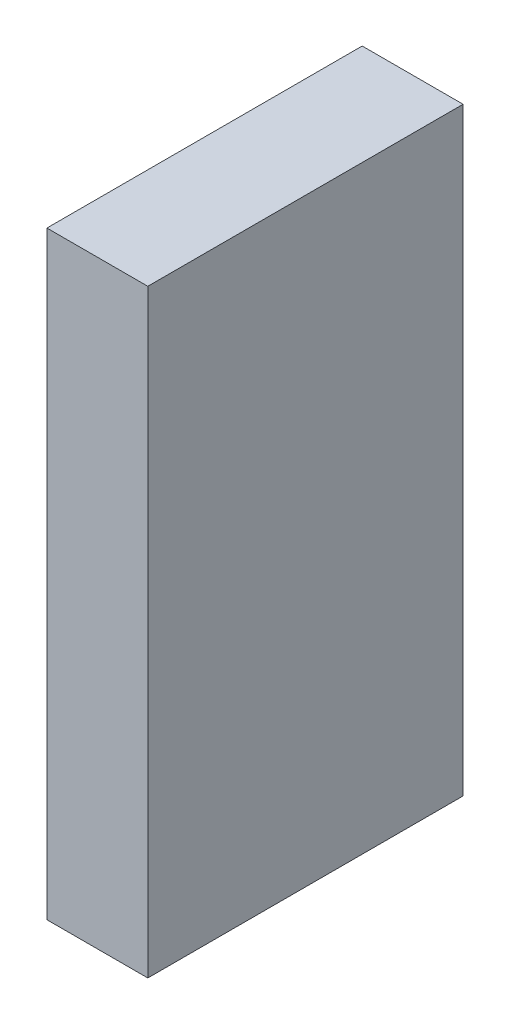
ISO-10303-21;
HEADER;
FILE_DESCRIPTION(('STEP AP214'),'2;1');
FILE_NAME('part.step','',(''),(''),'','','');
FILE_SCHEMA(('AUTOMOTIVE_DESIGN { 1 0 10303 214 1 1 1 1 }'));
ENDSEC;
DATA;
#1=APPLICATION_CONTEXT('core data for automotive mechanical design processes');
#2=APPLICATION_PROTOCOL_DEFINITION('international standard','automotive_design',2000,#1);
#3=PRODUCT_CONTEXT('',#1,'mechanical');
#4=PRODUCT('Part','Part','',(#3));
#5=PRODUCT_RELATED_PRODUCT_CATEGORY('part','',(#4));
#6=PRODUCT_DEFINITION_FORMATION('','',#4);
#7=PRODUCT_DEFINITION_CONTEXT('part definition',#1,'design');
#8=PRODUCT_DEFINITION('design','',#6,#7);
#9=PRODUCT_DEFINITION_SHAPE('','',#8);
#10=(LENGTH_UNIT() NAMED_UNIT(*) SI_UNIT(.MILLI.,.METRE.));
#11=(NAMED_UNIT(*) PLANE_ANGLE_UNIT() SI_UNIT($,.RADIAN.));
#12=(NAMED_UNIT(*) SI_UNIT($,.STERADIAN.) SOLID_ANGLE_UNIT());
#13=UNCERTAINTY_MEASURE_WITH_UNIT(LENGTH_MEASURE(1.E-05),#10,'distance_accuracy_value','');
#14=(GEOMETRIC_REPRESENTATION_CONTEXT(3) GLOBAL_UNCERTAINTY_ASSIGNED_CONTEXT((#13)) GLOBAL_UNIT_ASSIGNED_CONTEXT((#10,
#11,#12)) REPRESENTATION_CONTEXT('',''));
#15=CARTESIAN_POINT('',(0.,0.,0.));
#16=DIRECTION('',(0.,0.,1.));
#17=DIRECTION('',(1.,0.,0.));
#18=AXIS2_PLACEMENT_3D('',#15,#16,#17);
#19=CARTESIAN_POINT('',(0.,0.,25.));
#20=DIRECTION('',(1.,0.,0.));
#21=DIRECTION('',(0.,1.,0.));
#22=AXIS2_PLACEMENT_3D('',#19,#20,#21);
#23=PLANE('',#22);
#24=DIRECTION('',(0.,-1.,0.));
#25=VECTOR('',#24,1.);
#26=CARTESIAN_POINT('',(0.,0.,0.));
#27=LINE('',#26,#25);
#28=CARTESIAN_POINT('',(0.,47.5,0.));
#29=VERTEX_POINT('',#28);
#30=CARTESIAN_POINT('',(0.,0.,0.));
#31=VERTEX_POINT('',#30);
#32=EDGE_CURVE('E93',#29,#31,#27,.T.);
#33=ORIENTED_EDGE('',*,*,#32,.T.);
#34=DIRECTION('',(0.,0.,-1.));
#35=VECTOR('',#34,1.);
#36=CARTESIAN_POINT('',(0.,0.,25.));
#37=LINE('',#36,#35);
#38=CARTESIAN_POINT('',(0.,0.,25.));
#39=VERTEX_POINT('',#38);
#40=EDGE_CURVE('E11',#39,#31,#37,.T.);
#41=ORIENTED_EDGE('',*,*,#40,.F.);
#42=DIRECTION('',(0.,-1.,0.));
#43=VECTOR('',#42,1.);
#44=CARTESIAN_POINT('',(0.,0.,25.));
#45=LINE('',#44,#43);
#46=CARTESIAN_POINT('',(0.,47.5,25.));
#47=VERTEX_POINT('',#46);
#48=EDGE_CURVE('E81',#47,#39,#45,.T.);
#49=ORIENTED_EDGE('',*,*,#48,.F.);
#50=DIRECTION('',(0.,0.,-1.));
#51=VECTOR('',#50,1.);
#52=CARTESIAN_POINT('',(0.,47.5,25.));
#53=LINE('',#52,#51);
#54=EDGE_CURVE('E89',#47,#29,#53,.T.);
#55=ORIENTED_EDGE('',*,*,#54,.T.);
#56=EDGE_LOOP('',(#33,#41,#49,#55));
#57=FACE_BOUND('',#56,.T.);
#58=ADVANCED_FACE('F30',(#57),#23,.F.);
#59=CARTESIAN_POINT('',(0.,0.,25.));
#60=DIRECTION('',(0.,1.,0.));
#61=DIRECTION('',(0.,0.,1.));
#62=AXIS2_PLACEMENT_3D('',#59,#60,#61);
#63=PLANE('',#62);
#64=DIRECTION('',(1.,0.,0.));
#65=VECTOR('',#64,1.);
#66=CARTESIAN_POINT('',(0.,0.,0.));
#67=LINE('',#66,#65);
#68=CARTESIAN_POINT('',(8.,0.,0.));
#69=VERTEX_POINT('',#68);
#70=EDGE_CURVE('E85',#31,#69,#67,.T.);
#71=ORIENTED_EDGE('',*,*,#70,.T.);
#72=DIRECTION('',(0.,0.,-1.));
#73=VECTOR('',#72,1.);
#74=CARTESIAN_POINT('',(8.,0.,25.));
#75=LINE('',#74,#73);
#76=CARTESIAN_POINT('',(8.,0.,25.));
#77=VERTEX_POINT('',#76);
#78=EDGE_CURVE('E38',#77,#69,#75,.T.);
#79=ORIENTED_EDGE('',*,*,#78,.F.);
#80=DIRECTION('',(1.,0.,0.));
#81=VECTOR('',#80,1.);
#82=CARTESIAN_POINT('',(0.,0.,25.));
#83=LINE('',#82,#81);
#84=EDGE_CURVE('E76',#39,#77,#83,.T.);
#85=ORIENTED_EDGE('',*,*,#84,.F.);
#86=ORIENTED_EDGE('',*,*,#40,.T.);
#87=EDGE_LOOP('',(#71,#79,#85,#86));
#88=FACE_BOUND('',#87,.T.);
#89=ADVANCED_FACE('F84',(#88),#63,.F.);
#90=CARTESIAN_POINT('',(8.,0.,25.));
#91=DIRECTION('',(-1.,0.,0.));
#92=DIRECTION('',(0.,-1.,0.));
#93=AXIS2_PLACEMENT_3D('',#90,#91,#92);
#94=PLANE('',#93);
#95=DIRECTION('',(0.,1.,0.));
#96=VECTOR('',#95,1.);
#97=CARTESIAN_POINT('',(8.,0.,0.));
#98=LINE('',#97,#96);
#99=CARTESIAN_POINT('',(7.99999999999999,47.5,0.));
#100=VERTEX_POINT('',#99);
#101=EDGE_CURVE('E63',#69,#100,#98,.T.);
#102=ORIENTED_EDGE('',*,*,#101,.T.);
#103=DIRECTION('',(0.,0.,-1.));
#104=VECTOR('',#103,1.);
#105=CARTESIAN_POINT('',(7.99999999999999,47.5,25.));
#106=LINE('',#105,#104);
#107=CARTESIAN_POINT('',(7.99999999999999,47.5,25.));
#108=VERTEX_POINT('',#107);
#109=EDGE_CURVE('E86',#108,#100,#106,.T.);
#110=ORIENTED_EDGE('',*,*,#109,.F.);
#111=DIRECTION('',(0.,1.,0.));
#112=VECTOR('',#111,1.);
#113=CARTESIAN_POINT('',(8.,0.,25.));
#114=LINE('',#113,#112);
#115=EDGE_CURVE('E79',#77,#108,#114,.T.);
#116=ORIENTED_EDGE('',*,*,#115,.F.);
#117=ORIENTED_EDGE('',*,*,#78,.T.);
#118=EDGE_LOOP('',(#102,#110,#116,#117));
#119=FACE_BOUND('',#118,.T.);
#120=ADVANCED_FACE('F87',(#119),#94,.F.);
#121=CARTESIAN_POINT('',(0.,47.5,25.));
#122=DIRECTION('',(0.,-1.,0.));
#123=DIRECTION('',(0.,0.,-1.));
#124=AXIS2_PLACEMENT_3D('',#121,#122,#123);
#125=PLANE('',#124);
#126=DIRECTION('',(-1.,0.,0.));
#127=VECTOR('',#126,1.);
#128=CARTESIAN_POINT('',(0.,47.5,0.));
#129=LINE('',#128,#127);
#130=EDGE_CURVE('E69',#100,#29,#129,.T.);
#131=ORIENTED_EDGE('',*,*,#130,.T.);
#132=ORIENTED_EDGE('',*,*,#54,.F.);
#133=DIRECTION('',(-1.,0.,0.));
#134=VECTOR('',#133,1.);
#135=CARTESIAN_POINT('',(0.,47.5,25.));
#136=LINE('',#135,#134);
#137=EDGE_CURVE('E46',#108,#47,#136,.T.);
#138=ORIENTED_EDGE('',*,*,#137,.F.);
#139=ORIENTED_EDGE('',*,*,#109,.T.);
#140=EDGE_LOOP('',(#131,#132,#138,#139));
#141=FACE_BOUND('',#140,.T.);
#142=ADVANCED_FACE('F100',(#141),#125,.F.);
#143=CARTESIAN_POINT('',(0.,47.5,25.));
#144=DIRECTION('',(0.,0.,-1.));
#145=DIRECTION('',(-1.,0.,0.));
#146=AXIS2_PLACEMENT_3D('',#143,#144,#145);
#147=PLANE('',#146);
#148=ORIENTED_EDGE('',*,*,#48,.T.);
#149=ORIENTED_EDGE('',*,*,#84,.T.);
#150=ORIENTED_EDGE('',*,*,#115,.T.);
#151=ORIENTED_EDGE('',*,*,#137,.T.);
#152=EDGE_LOOP('',(#148,#149,#150,#151));
#153=FACE_BOUND('',#152,.T.);
#154=ADVANCED_FACE('F77',(#153),#147,.F.);
#155=CARTESIAN_POINT('',(0.,47.5,0.));
#156=DIRECTION('',(0.,0.,-1.));
#157=DIRECTION('',(-1.,0.,0.));
#158=AXIS2_PLACEMENT_3D('',#155,#156,#157);
#159=PLANE('',#158);
#160=ORIENTED_EDGE('',*,*,#32,.F.);
#161=ORIENTED_EDGE('',*,*,#130,.F.);
#162=ORIENTED_EDGE('',*,*,#101,.F.);
#163=ORIENTED_EDGE('',*,*,#70,.F.);
#164=EDGE_LOOP('',(#160,#161,#162,#163));
#165=FACE_BOUND('',#164,.T.);
#166=ADVANCED_FACE('F103',(#165),#159,.T.);
#167=CLOSED_SHELL('',(#58,#89,#120,#142,#154,#166));
#168=MANIFOLD_SOLID_BREP('B2',#167);
#169=ADVANCED_BREP_SHAPE_REPRESENTATION('',(#18,#168),#14);
#170=SHAPE_DEFINITION_REPRESENTATION(#9,#169);
ENDSEC;
END-ISO-10303-21;
